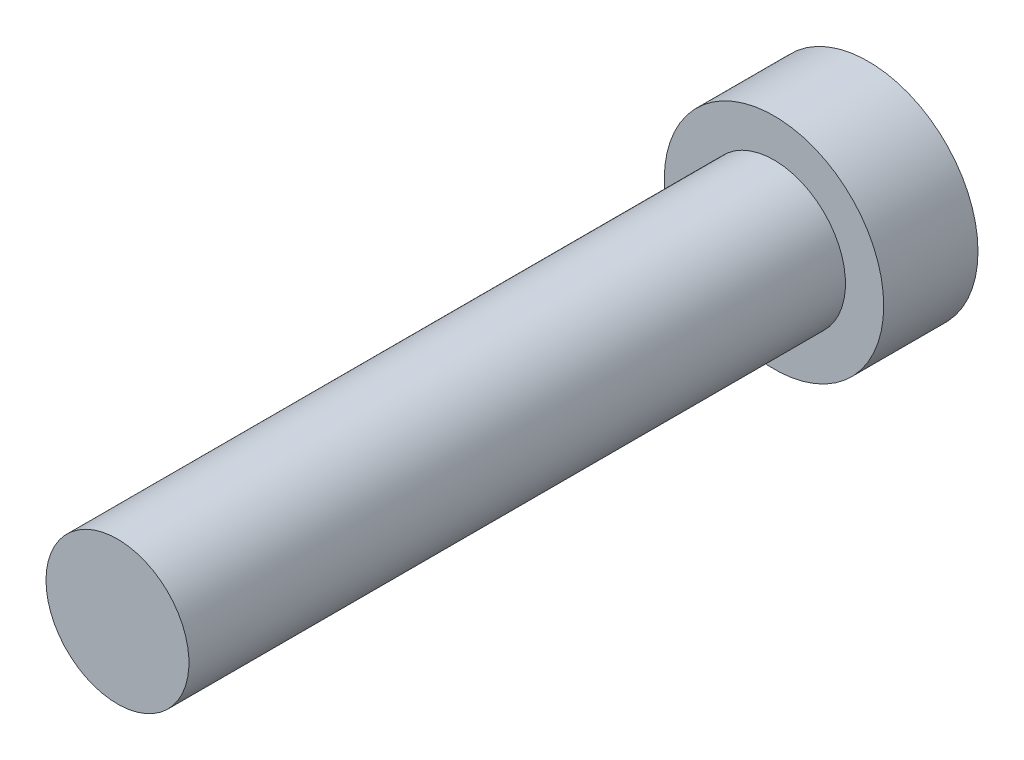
from build123d import *


with BuildPart() as part:
    # Logo3_bib1 → Revolve1 (revolve)
    with BuildSketch(Plane(origin=(0, 0, 0), x_dir=(-1, 0, 0), z_dir=(0, -1, 0))):
        Polygon((3.6195, 0), (5.55625, 0), (5.55625, 4.7752), (0, 4.7752), (0, -33.24987), (3.6195, -33.24987), align=None)
    revolve(axis=Axis((0, 0, -16.546754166), (0, 0, 1)))


solid = part.part
